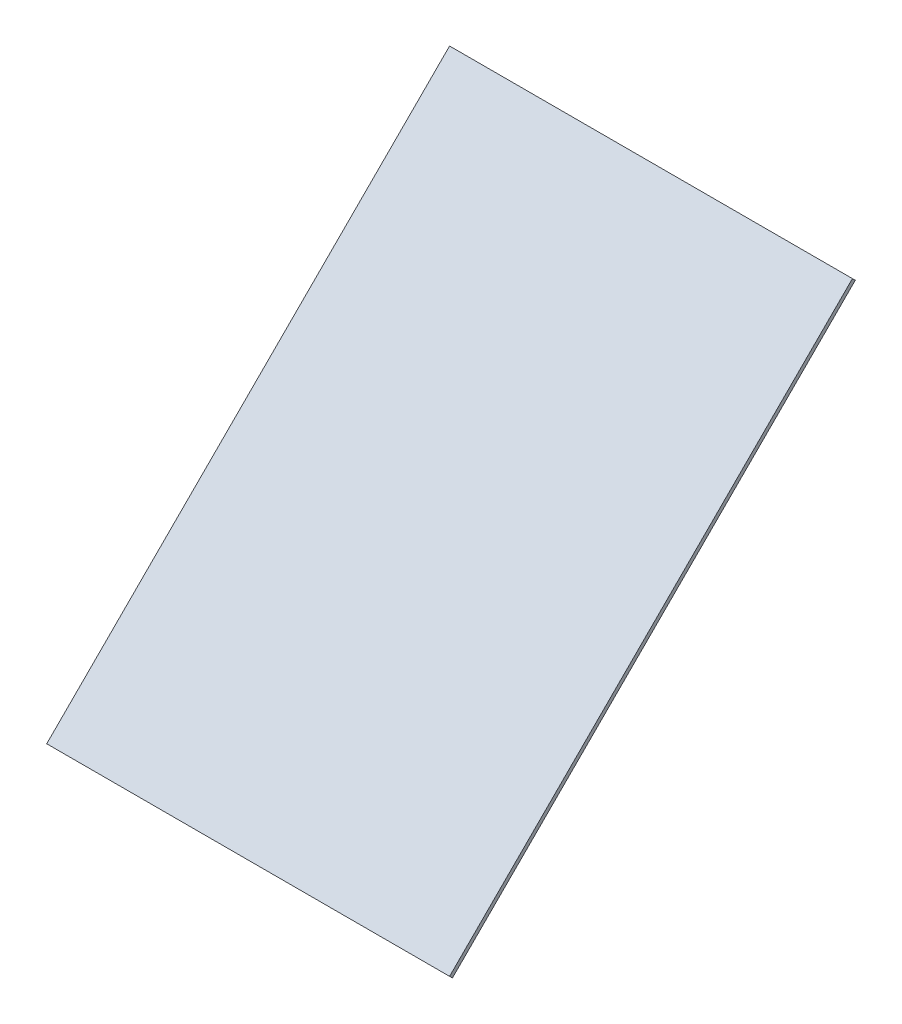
ISO-10303-21;
HEADER;
FILE_DESCRIPTION(('STEP AP214'),'2;1');
FILE_NAME('part.step','',(''),(''),'','','');
FILE_SCHEMA(('AUTOMOTIVE_DESIGN { 1 0 10303 214 1 1 1 1 }'));
ENDSEC;
DATA;
#1=APPLICATION_CONTEXT('core data for automotive mechanical design processes');
#2=APPLICATION_PROTOCOL_DEFINITION('international standard','automotive_design',2000,#1);
#3=PRODUCT_CONTEXT('',#1,'mechanical');
#4=PRODUCT('Part','Part','',(#3));
#5=PRODUCT_RELATED_PRODUCT_CATEGORY('part','',(#4));
#6=PRODUCT_DEFINITION_FORMATION('','',#4);
#7=PRODUCT_DEFINITION_CONTEXT('part definition',#1,'design');
#8=PRODUCT_DEFINITION('design','',#6,#7);
#9=PRODUCT_DEFINITION_SHAPE('','',#8);
#10=(LENGTH_UNIT() NAMED_UNIT(*) SI_UNIT(.MILLI.,.METRE.));
#11=(NAMED_UNIT(*) PLANE_ANGLE_UNIT() SI_UNIT($,.RADIAN.));
#12=(NAMED_UNIT(*) SI_UNIT($,.STERADIAN.) SOLID_ANGLE_UNIT());
#13=UNCERTAINTY_MEASURE_WITH_UNIT(LENGTH_MEASURE(1.E-05),#10,'distance_accuracy_value','');
#14=(GEOMETRIC_REPRESENTATION_CONTEXT(3) GLOBAL_UNCERTAINTY_ASSIGNED_CONTEXT((#13)) GLOBAL_UNIT_ASSIGNED_CONTEXT((#10,
#11,#12)) REPRESENTATION_CONTEXT('',''));
#15=CARTESIAN_POINT('',(0.,0.,0.));
#16=DIRECTION('',(0.,0.,1.));
#17=DIRECTION('',(1.,0.,0.));
#18=AXIS2_PLACEMENT_3D('',#15,#16,#17);
#19=CARTESIAN_POINT('',(-21.1242,87.9133133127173,91.1002240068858));
#20=DIRECTION('',(0.,0.707106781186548,0.707106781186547));
#21=DIRECTION('',(0.,-0.707106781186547,0.707106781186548));
#22=AXIS2_PLACEMENT_3D('',#19,#20,#21);
#23=PLANE('',#22);
#24=DIRECTION('',(1.,0.,0.));
#25=VECTOR('',#24,1.);
#26=CARTESIAN_POINT('',(0.,-49.2924137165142,228.305951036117));
#27=LINE('',#26,#25);
#28=CARTESIAN_POINT('',(-50.,-49.2924137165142,228.305951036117));
#29=VERTEX_POINT('',#28);
#30=CARTESIAN_POINT('',(50.,-49.2924137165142,228.305951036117));
#31=VERTEX_POINT('',#30);
#32=EDGE_CURVE('E11',#29,#31,#27,.T.);
#33=ORIENTED_EDGE('',*,*,#32,.T.);
#34=DIRECTION('',(0.,0.707106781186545,-0.70710678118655));
#35=VECTOR('',#34,1.);
#36=CARTESIAN_POINT('',(50.,0.707106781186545,178.306430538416));
#37=LINE('',#36,#35);
#38=CARTESIAN_POINT('',(50.,50.7066272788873,128.306910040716));
#39=VERTEX_POINT('',#38);
#40=EDGE_CURVE('E26',#31,#39,#37,.T.);
#41=ORIENTED_EDGE('',*,*,#40,.T.);
#42=DIRECTION('',(-1.,0.,0.));
#43=VECTOR('',#42,1.);
#44=CARTESIAN_POINT('',(0.,50.7066272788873,128.306910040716));
#45=LINE('',#44,#43);
#46=CARTESIAN_POINT('',(-50.,50.7066272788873,128.306910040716));
#47=VERTEX_POINT('',#46);
#48=EDGE_CURVE('E80',#39,#47,#45,.T.);
#49=ORIENTED_EDGE('',*,*,#48,.T.);
#50=DIRECTION('',(0.,-0.707106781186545,0.70710678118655));
#51=VECTOR('',#50,1.);
#52=CARTESIAN_POINT('',(-50.,0.707106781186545,178.306430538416));
#53=LINE('',#52,#51);
#54=EDGE_CURVE('E62',#47,#29,#53,.T.);
#55=ORIENTED_EDGE('',*,*,#54,.T.);
#56=EDGE_LOOP('',(#33,#41,#49,#55));
#57=FACE_BOUND('',#56,.T.);
#58=ADVANCED_FACE('F16',(#57),#23,.T.);
#59=CARTESIAN_POINT('',(-123.3282,-14.9370650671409,192.536388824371));
#60=DIRECTION('',(0.,-0.707106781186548,-0.707106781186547));
#61=DIRECTION('',(0.,0.707106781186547,-0.707106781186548));
#62=AXIS2_PLACEMENT_3D('',#59,#60,#61);
#63=PLANE('',#62);
#64=DIRECTION('',(0.,-0.707106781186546,0.707106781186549));
#65=VECTOR('',#64,1.);
#66=CARTESIAN_POINT('',(-50.,0.,177.59932375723));
#67=LINE('',#66,#65);
#68=CARTESIAN_POINT('',(-50.,49.9995204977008,127.599803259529));
#69=VERTEX_POINT('',#68);
#70=CARTESIAN_POINT('',(-50.,-49.9995204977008,227.598844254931));
#71=VERTEX_POINT('',#70);
#72=EDGE_CURVE('E61',#69,#71,#67,.T.);
#73=ORIENTED_EDGE('',*,*,#72,.F.);
#74=DIRECTION('',(-1.,0.,0.));
#75=VECTOR('',#74,1.);
#76=CARTESIAN_POINT('',(0.,49.9995204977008,127.599803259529));
#77=LINE('',#76,#75);
#78=CARTESIAN_POINT('',(50.,49.9995204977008,127.599803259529));
#79=VERTEX_POINT('',#78);
#80=EDGE_CURVE('E65',#79,#69,#77,.T.);
#81=ORIENTED_EDGE('',*,*,#80,.F.);
#82=DIRECTION('',(0.,0.707106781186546,-0.707106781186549));
#83=VECTOR('',#82,1.);
#84=CARTESIAN_POINT('',(50.,0.,177.59932375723));
#85=LINE('',#84,#83);
#86=CARTESIAN_POINT('',(50.,-49.9995204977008,227.598844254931));
#87=VERTEX_POINT('',#86);
#88=EDGE_CURVE('E66',#87,#79,#85,.T.);
#89=ORIENTED_EDGE('',*,*,#88,.F.);
#90=DIRECTION('',(1.,0.,0.));
#91=VECTOR('',#90,1.);
#92=CARTESIAN_POINT('',(0.,-49.9995204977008,227.598844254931));
#93=LINE('',#92,#91);
#94=EDGE_CURVE('E78',#71,#87,#93,.T.);
#95=ORIENTED_EDGE('',*,*,#94,.F.);
#96=EDGE_LOOP('',(#73,#81,#89,#95));
#97=FACE_BOUND('',#96,.T.);
#98=ADVANCED_FACE('F77',(#97),#63,.T.);
#99=CARTESIAN_POINT('',(-50.,49.9995204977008,127.599803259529));
#100=DIRECTION('',(-1.,0.,0.));
#101=DIRECTION('',(0.,0.,1.));
#102=AXIS2_PLACEMENT_3D('',#99,#100,#101);
#103=PLANE('',#102);
#104=ORIENTED_EDGE('',*,*,#72,.T.);
#105=DIRECTION('',(0.,0.707106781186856,0.707106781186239));
#106=VECTOR('',#105,1.);
#107=CARTESIAN_POINT('',(-50.,-49.6459671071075,227.952397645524));
#108=LINE('',#107,#106);
#109=EDGE_CURVE('E53',#71,#29,#108,.T.);
#110=ORIENTED_EDGE('',*,*,#109,.T.);
#111=ORIENTED_EDGE('',*,*,#54,.F.);
#112=DIRECTION('',(0.,0.707106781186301,0.707106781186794));
#113=VECTOR('',#112,1.);
#114=CARTESIAN_POINT('',(-50.,50.353073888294,127.953356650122));
#115=LINE('',#114,#113);
#116=EDGE_CURVE('E57',#69,#47,#115,.T.);
#117=ORIENTED_EDGE('',*,*,#116,.F.);
#118=EDGE_LOOP('',(#104,#110,#111,#117));
#119=FACE_BOUND('',#118,.T.);
#120=ADVANCED_FACE('F59',(#119),#103,.T.);
#121=CARTESIAN_POINT('',(50.,49.9995204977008,127.599803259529));
#122=DIRECTION('',(0.,0.707106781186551,-0.707106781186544));
#123=DIRECTION('',(0.,0.707106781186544,0.707106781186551));
#124=AXIS2_PLACEMENT_3D('',#121,#122,#123);
#125=PLANE('',#124);
#126=ORIENTED_EDGE('',*,*,#80,.T.);
#127=ORIENTED_EDGE('',*,*,#116,.T.);
#128=ORIENTED_EDGE('',*,*,#48,.F.);
#129=DIRECTION('',(0.,0.707106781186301,0.707106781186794));
#130=VECTOR('',#129,1.);
#131=CARTESIAN_POINT('',(50.,50.353073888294,127.953356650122));
#132=LINE('',#131,#130);
#133=EDGE_CURVE('E72',#79,#39,#132,.T.);
#134=ORIENTED_EDGE('',*,*,#133,.F.);
#135=EDGE_LOOP('',(#126,#127,#128,#134));
#136=FACE_BOUND('',#135,.T.);
#137=ADVANCED_FACE('F70',(#136),#125,.T.);
#138=CARTESIAN_POINT('',(50.,-49.9995204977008,227.598844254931));
#139=DIRECTION('',(1.,0.,0.));
#140=DIRECTION('',(0.,0.,-1.));
#141=AXIS2_PLACEMENT_3D('',#138,#139,#140);
#142=PLANE('',#141);
#143=ORIENTED_EDGE('',*,*,#88,.T.);
#144=ORIENTED_EDGE('',*,*,#133,.T.);
#145=ORIENTED_EDGE('',*,*,#40,.F.);
#146=DIRECTION('',(0.,0.707106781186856,0.707106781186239));
#147=VECTOR('',#146,1.);
#148=CARTESIAN_POINT('',(50.,-49.6459671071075,227.952397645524));
#149=LINE('',#148,#147);
#150=EDGE_CURVE('E20',#87,#31,#149,.T.);
#151=ORIENTED_EDGE('',*,*,#150,.F.);
#152=EDGE_LOOP('',(#143,#144,#145,#151));
#153=FACE_BOUND('',#152,.T.);
#154=ADVANCED_FACE('F90',(#153),#142,.T.);
#155=CARTESIAN_POINT('',(-50.,-49.9995204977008,227.598844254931));
#156=DIRECTION('',(0.,-0.707106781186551,0.707106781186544));
#157=DIRECTION('',(0.,-0.707106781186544,-0.707106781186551));
#158=AXIS2_PLACEMENT_3D('',#155,#156,#157);
#159=PLANE('',#158);
#160=ORIENTED_EDGE('',*,*,#94,.T.);
#161=ORIENTED_EDGE('',*,*,#150,.T.);
#162=ORIENTED_EDGE('',*,*,#32,.F.);
#163=ORIENTED_EDGE('',*,*,#109,.F.);
#164=EDGE_LOOP('',(#160,#161,#162,#163));
#165=FACE_BOUND('',#164,.T.);
#166=ADVANCED_FACE('F18',(#165),#159,.T.);
#167=CLOSED_SHELL('',(#58,#98,#120,#137,#154,#166));
#168=MANIFOLD_SOLID_BREP('B1',#167);
#169=ADVANCED_BREP_SHAPE_REPRESENTATION('',(#18,#168),#14);
#170=SHAPE_DEFINITION_REPRESENTATION(#9,#169);
ENDSEC;
END-ISO-10303-21;
